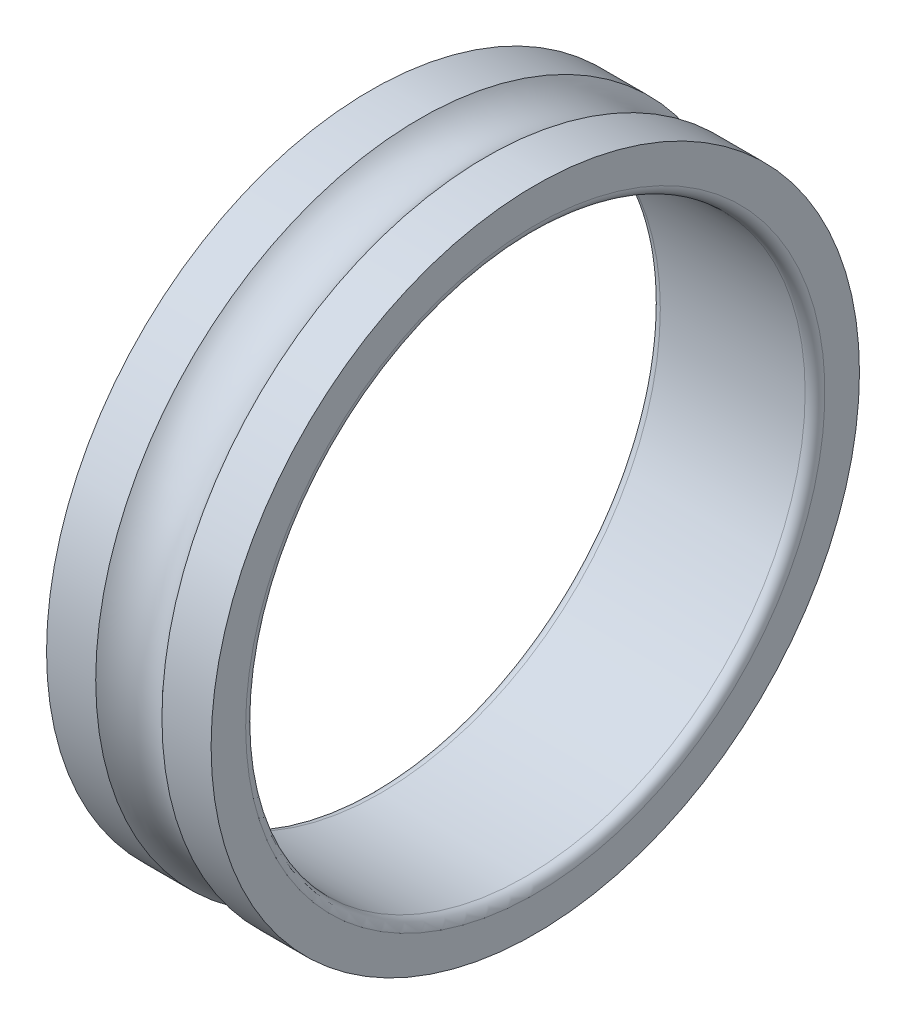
ISO-10303-21;
HEADER;
FILE_DESCRIPTION(('STEP AP214'),'2;1');
FILE_NAME('part.step','',(''),(''),'','','');
FILE_SCHEMA(('AUTOMOTIVE_DESIGN { 1 0 10303 214 1 1 1 1 }'));
ENDSEC;
DATA;
#1=APPLICATION_CONTEXT('core data for automotive mechanical design processes');
#2=APPLICATION_PROTOCOL_DEFINITION('international standard','automotive_design',2000,#1);
#3=PRODUCT_CONTEXT('',#1,'mechanical');
#4=PRODUCT('Part','Part','',(#3));
#5=PRODUCT_RELATED_PRODUCT_CATEGORY('part','',(#4));
#6=PRODUCT_DEFINITION_FORMATION('','',#4);
#7=PRODUCT_DEFINITION_CONTEXT('part definition',#1,'design');
#8=PRODUCT_DEFINITION('design','',#6,#7);
#9=PRODUCT_DEFINITION_SHAPE('','',#8);
#10=(LENGTH_UNIT() NAMED_UNIT(*) SI_UNIT(.MILLI.,.METRE.));
#11=(NAMED_UNIT(*) PLANE_ANGLE_UNIT() SI_UNIT($,.RADIAN.));
#12=(NAMED_UNIT(*) SI_UNIT($,.STERADIAN.) SOLID_ANGLE_UNIT());
#13=UNCERTAINTY_MEASURE_WITH_UNIT(LENGTH_MEASURE(1.E-05),#10,'distance_accuracy_value','');
#14=(GEOMETRIC_REPRESENTATION_CONTEXT(3) GLOBAL_UNCERTAINTY_ASSIGNED_CONTEXT((#13)) GLOBAL_UNIT_ASSIGNED_CONTEXT((#10,
#11,#12)) REPRESENTATION_CONTEXT('',''));
#15=CARTESIAN_POINT('',(0.,0.,0.));
#16=DIRECTION('',(0.,0.,1.));
#17=DIRECTION('',(1.,0.,0.));
#18=AXIS2_PLACEMENT_3D('',#15,#16,#17);
#19=CARTESIAN_POINT('',(0.300000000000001,0.,0.));
#20=DIRECTION('',(-1.,0.,0.));
#21=DIRECTION('',(0.,0.,1.));
#22=AXIS2_PLACEMENT_3D('',#19,#20,#21);
#23=TOROIDAL_SURFACE('',#22,8.8,0.3);
#24=CARTESIAN_POINT('',(0.300000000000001,0.,0.));
#25=DIRECTION('',(-1.,0.,0.));
#26=DIRECTION('',(0.,0.,1.));
#27=AXIS2_PLACEMENT_3D('',#24,#25,#26);
#28=CIRCLE('',#27,8.5);
#29=CARTESIAN_POINT('',(0.300000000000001,0.,8.5));
#30=VERTEX_POINT('',#29);
#31=EDGE_CURVE('E10',#30,#30,#28,.T.);
#32=ORIENTED_EDGE('',*,*,#31,.F.);
#33=EDGE_LOOP('',(#32));
#34=FACE_BOUND('',#33,.T.);
#35=CARTESIAN_POINT('',(0.,0.,0.));
#36=DIRECTION('',(-1.,0.,0.));
#37=DIRECTION('',(0.,0.,1.));
#38=AXIS2_PLACEMENT_3D('',#35,#36,#37);
#39=CIRCLE('',#38,8.8);
#40=CARTESIAN_POINT('',(0.,0.,8.8));
#41=VERTEX_POINT('',#40);
#42=EDGE_CURVE('E59',#41,#41,#39,.T.);
#43=ORIENTED_EDGE('',*,*,#42,.T.);
#44=EDGE_LOOP('',(#43));
#45=FACE_BOUND('',#44,.T.);
#46=ADVANCED_FACE('F31',(#34,#45),#23,.T.);
#47=CARTESIAN_POINT('',(0.,0.,0.));
#48=DIRECTION('',(-1.,0.,0.));
#49=DIRECTION('',(0.,0.,1.));
#50=AXIS2_PLACEMENT_3D('',#47,#48,#49);
#51=CYLINDRICAL_SURFACE('',#50,8.5);
#52=CARTESIAN_POINT('',(4.7,0.,0.));
#53=DIRECTION('',(-1.,0.,0.));
#54=DIRECTION('',(0.,0.,1.));
#55=AXIS2_PLACEMENT_3D('',#52,#53,#54);
#56=CIRCLE('',#55,8.5);
#57=CARTESIAN_POINT('',(4.7,0.,8.5));
#58=VERTEX_POINT('',#57);
#59=EDGE_CURVE('E37',#58,#58,#56,.T.);
#60=ORIENTED_EDGE('',*,*,#59,.F.);
#61=EDGE_LOOP('',(#60));
#62=FACE_BOUND('',#61,.T.);
#63=ORIENTED_EDGE('',*,*,#31,.T.);
#64=EDGE_LOOP('',(#63));
#65=FACE_BOUND('',#64,.T.);
#66=ADVANCED_FACE('F96',(#62,#65),#51,.F.);
#67=CARTESIAN_POINT('',(4.7,0.,0.));
#68=DIRECTION('',(-1.,0.,0.));
#69=DIRECTION('',(0.,0.,1.));
#70=AXIS2_PLACEMENT_3D('',#67,#68,#69);
#71=TOROIDAL_SURFACE('',#70,8.8,0.3);
#72=CARTESIAN_POINT('',(5.,0.,0.));
#73=DIRECTION('',(-1.,0.,0.));
#74=DIRECTION('',(0.,0.,1.));
#75=AXIS2_PLACEMENT_3D('',#72,#73,#74);
#76=CIRCLE('',#75,8.8);
#77=CARTESIAN_POINT('',(5.,0.,8.8));
#78=VERTEX_POINT('',#77);
#79=EDGE_CURVE('E41',#78,#78,#76,.T.);
#80=ORIENTED_EDGE('',*,*,#79,.F.);
#81=EDGE_LOOP('',(#80));
#82=FACE_BOUND('',#81,.T.);
#83=ORIENTED_EDGE('',*,*,#59,.T.);
#84=EDGE_LOOP('',(#83));
#85=FACE_BOUND('',#84,.T.);
#86=ADVANCED_FACE('F91',(#82,#85),#71,.T.);
#87=CARTESIAN_POINT('',(5.,0.,-9.85));
#88=DIRECTION('',(-1.,0.,0.));
#89=DIRECTION('',(0.,0.,1.));
#90=AXIS2_PLACEMENT_3D('',#87,#88,#89);
#91=PLANE('',#90);
#92=CARTESIAN_POINT('',(5.,0.,0.));
#93=DIRECTION('',(-1.,0.,0.));
#94=DIRECTION('',(0.,0.,1.));
#95=AXIS2_PLACEMENT_3D('',#92,#93,#94);
#96=CIRCLE('',#95,9.85);
#97=CARTESIAN_POINT('',(5.,0.,9.85));
#98=VERTEX_POINT('',#97);
#99=EDGE_CURVE('E45',#98,#98,#96,.T.);
#100=ORIENTED_EDGE('',*,*,#99,.F.);
#101=EDGE_LOOP('',(#100));
#102=FACE_BOUND('',#101,.T.);
#103=ORIENTED_EDGE('',*,*,#79,.T.);
#104=EDGE_LOOP('',(#103));
#105=FACE_BOUND('',#104,.T.);
#106=ADVANCED_FACE('F85',(#102,#105),#91,.F.);
#107=CARTESIAN_POINT('',(0.,0.,0.));
#108=DIRECTION('',(-1.,0.,0.));
#109=DIRECTION('',(0.,0.,1.));
#110=AXIS2_PLACEMENT_3D('',#107,#108,#109);
#111=CYLINDRICAL_SURFACE('',#110,9.85);
#112=CARTESIAN_POINT('',(3.5062305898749,0.,0.));
#113=DIRECTION('',(-1.,0.,0.));
#114=DIRECTION('',(0.,0.,1.));
#115=AXIS2_PLACEMENT_3D('',#112,#113,#114);
#116=CIRCLE('',#115,9.85);
#117=CARTESIAN_POINT('',(3.5062305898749,0.,9.85));
#118=VERTEX_POINT('',#117);
#119=EDGE_CURVE('E50',#118,#118,#116,.T.);
#120=ORIENTED_EDGE('',*,*,#119,.F.);
#121=EDGE_LOOP('',(#120));
#122=FACE_BOUND('',#121,.T.);
#123=ORIENTED_EDGE('',*,*,#99,.T.);
#124=EDGE_LOOP('',(#123));
#125=FACE_BOUND('',#124,.T.);
#126=ADVANCED_FACE('F79',(#122,#125),#111,.T.);
#127=CARTESIAN_POINT('',(2.5,0.,0.));
#128=DIRECTION('',(-1.,0.,0.));
#129=DIRECTION('',(0.,0.,1.));
#130=AXIS2_PLACEMENT_3D('',#127,#128,#129);
#131=TOROIDAL_SURFACE('',#130,10.75,1.35);
#132=CARTESIAN_POINT('',(1.4937694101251,0.,0.));
#133=DIRECTION('',(-1.,0.,0.));
#134=DIRECTION('',(0.,0.,1.));
#135=AXIS2_PLACEMENT_3D('',#132,#133,#134);
#136=CIRCLE('',#135,9.85);
#137=CARTESIAN_POINT('',(1.4937694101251,0.,9.85));
#138=VERTEX_POINT('',#137);
#139=EDGE_CURVE('E53',#138,#138,#136,.T.);
#140=ORIENTED_EDGE('',*,*,#139,.F.);
#141=EDGE_LOOP('',(#140));
#142=FACE_BOUND('',#141,.T.);
#143=ORIENTED_EDGE('',*,*,#119,.T.);
#144=EDGE_LOOP('',(#143));
#145=FACE_BOUND('',#144,.T.);
#146=ADVANCED_FACE('F73',(#142,#145),#131,.F.);
#147=CARTESIAN_POINT('',(0.,0.,0.));
#148=DIRECTION('',(-1.,0.,0.));
#149=DIRECTION('',(0.,0.,1.));
#150=AXIS2_PLACEMENT_3D('',#147,#148,#149);
#151=CYLINDRICAL_SURFACE('',#150,9.85);
#152=CARTESIAN_POINT('',(0.,0.,0.));
#153=DIRECTION('',(-1.,0.,0.));
#154=DIRECTION('',(0.,0.,1.));
#155=AXIS2_PLACEMENT_3D('',#152,#153,#154);
#156=CIRCLE('',#155,9.85);
#157=CARTESIAN_POINT('',(0.,0.,9.85));
#158=VERTEX_POINT('',#157);
#159=EDGE_CURVE('E56',#158,#158,#156,.T.);
#160=ORIENTED_EDGE('',*,*,#159,.F.);
#161=EDGE_LOOP('',(#160));
#162=FACE_BOUND('',#161,.T.);
#163=ORIENTED_EDGE('',*,*,#139,.T.);
#164=EDGE_LOOP('',(#163));
#165=FACE_BOUND('',#164,.T.);
#166=ADVANCED_FACE('F67',(#162,#165),#151,.T.);
#167=CARTESIAN_POINT('',(0.,0.,-9.85));
#168=DIRECTION('',(1.,0.,0.));
#169=DIRECTION('',(0.,0.,-1.));
#170=AXIS2_PLACEMENT_3D('',#167,#168,#169);
#171=PLANE('',#170);
#172=ORIENTED_EDGE('',*,*,#42,.F.);
#173=EDGE_LOOP('',(#172));
#174=FACE_BOUND('',#173,.T.);
#175=ORIENTED_EDGE('',*,*,#159,.T.);
#176=EDGE_LOOP('',(#175));
#177=FACE_BOUND('',#176,.T.);
#178=ADVANCED_FACE('F64',(#174,#177),#171,.F.);
#179=CLOSED_SHELL('',(#46,#66,#86,#106,#126,#146,#166,#178));
#180=MANIFOLD_SOLID_BREP('B2',#179);
#181=ADVANCED_BREP_SHAPE_REPRESENTATION('',(#18,#180),#14);
#182=SHAPE_DEFINITION_REPRESENTATION(#9,#181);
ENDSEC;
END-ISO-10303-21;
